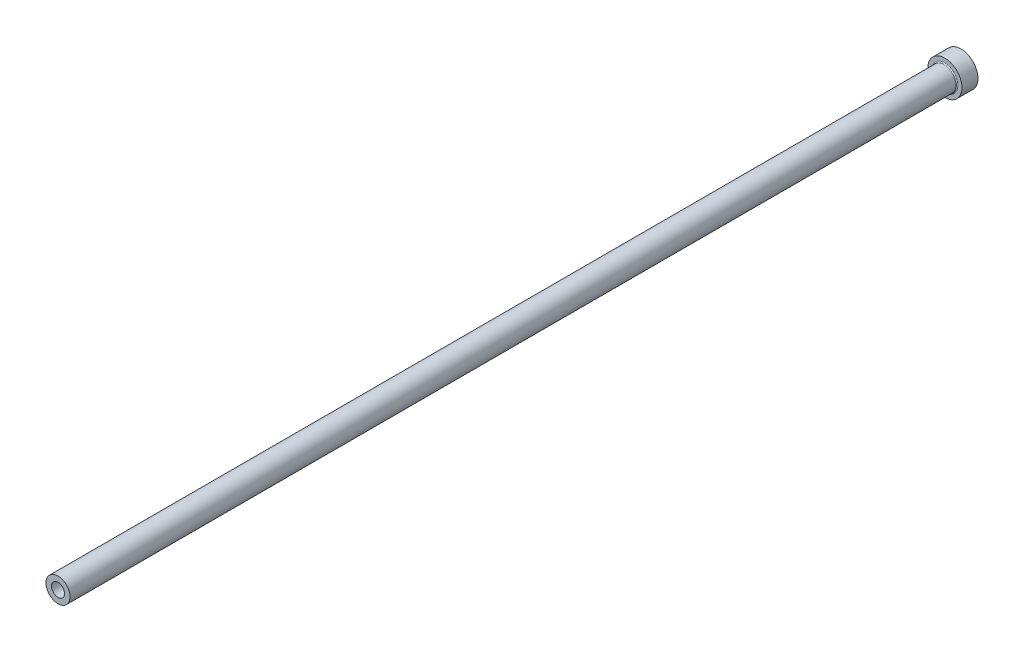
ISO-10303-21;
HEADER;
FILE_DESCRIPTION(('STEP AP214'),'2;1');
FILE_NAME('part.step','',(''),(''),'','','');
FILE_SCHEMA(('AUTOMOTIVE_DESIGN { 1 0 10303 214 1 1 1 1 }'));
ENDSEC;
DATA;
#1=APPLICATION_CONTEXT('core data for automotive mechanical design processes');
#2=APPLICATION_PROTOCOL_DEFINITION('international standard','automotive_design',2000,#1);
#3=PRODUCT_CONTEXT('',#1,'mechanical');
#4=PRODUCT('Part','Part','',(#3));
#5=PRODUCT_RELATED_PRODUCT_CATEGORY('part','',(#4));
#6=PRODUCT_DEFINITION_FORMATION('','',#4);
#7=PRODUCT_DEFINITION_CONTEXT('part definition',#1,'design');
#8=PRODUCT_DEFINITION('design','',#6,#7);
#9=PRODUCT_DEFINITION_SHAPE('','',#8);
#10=(LENGTH_UNIT() NAMED_UNIT(*) SI_UNIT(.MILLI.,.METRE.));
#11=(NAMED_UNIT(*) PLANE_ANGLE_UNIT() SI_UNIT($,.RADIAN.));
#12=(NAMED_UNIT(*) SI_UNIT($,.STERADIAN.) SOLID_ANGLE_UNIT());
#13=UNCERTAINTY_MEASURE_WITH_UNIT(LENGTH_MEASURE(1.E-05),#10,'distance_accuracy_value','');
#14=(GEOMETRIC_REPRESENTATION_CONTEXT(3) GLOBAL_UNCERTAINTY_ASSIGNED_CONTEXT((#13)) GLOBAL_UNIT_ASSIGNED_CONTEXT((#10,
#11,#12)) REPRESENTATION_CONTEXT('',''));
#15=CARTESIAN_POINT('',(0.,0.,0.));
#16=DIRECTION('',(0.,0.,1.));
#17=DIRECTION('',(1.,0.,0.));
#18=AXIS2_PLACEMENT_3D('',#15,#16,#17);
#19=CARTESIAN_POINT('',(0.,0.,450.));
#20=DIRECTION('',(0.,0.,-1.));
#21=DIRECTION('',(-1.,0.,0.));
#22=AXIS2_PLACEMENT_3D('',#19,#20,#21);
#23=PLANE('',#22);
#24=CARTESIAN_POINT('',(0.,0.,450.));
#25=DIRECTION('',(0.,0.,1.));
#26=DIRECTION('',(1.,0.,0.));
#27=AXIS2_PLACEMENT_3D('',#24,#25,#26);
#28=CIRCLE('',#27,3.24999999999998);
#29=CARTESIAN_POINT('',(3.24999999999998,0.,450.));
#30=VERTEX_POINT('',#29);
#31=EDGE_CURVE('E63',#30,#30,#28,.T.);
#32=ORIENTED_EDGE('',*,*,#31,.F.);
#33=EDGE_LOOP('',(#32));
#34=FACE_BOUND('',#33,.T.);
#35=CARTESIAN_POINT('',(0.,0.,450.));
#36=DIRECTION('',(0.,0.,1.));
#37=DIRECTION('',(1.,0.,0.));
#38=AXIS2_PLACEMENT_3D('',#35,#36,#37);
#39=CIRCLE('',#38,5.99999999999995);
#40=CARTESIAN_POINT('',(5.99999999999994,0.,450.));
#41=VERTEX_POINT('',#40);
#42=EDGE_CURVE('E54',#41,#41,#39,.T.);
#43=ORIENTED_EDGE('',*,*,#42,.T.);
#44=EDGE_LOOP('',(#43));
#45=FACE_BOUND('',#44,.T.);
#46=ADVANCED_FACE('F34',(#34,#45),#23,.F.);
#47=CARTESIAN_POINT('',(0.,0.,450.));
#48=DIRECTION('',(0.,0.,1.));
#49=DIRECTION('',(1.,0.,0.));
#50=AXIS2_PLACEMENT_3D('',#47,#48,#49);
#51=CYLINDRICAL_SURFACE('',#50,5.99999999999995);
#52=CARTESIAN_POINT('',(0.,0.,8.50000000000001));
#53=DIRECTION('',(0.,0.,1.));
#54=DIRECTION('',(1.,0.,0.));
#55=AXIS2_PLACEMENT_3D('',#52,#53,#54);
#56=CIRCLE('',#55,5.99999999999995);
#57=CARTESIAN_POINT('',(5.99999999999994,0.,8.50000000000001));
#58=VERTEX_POINT('',#57);
#59=EDGE_CURVE('E49',#58,#58,#56,.T.);
#60=ORIENTED_EDGE('',*,*,#59,.T.);
#61=EDGE_LOOP('',(#60));
#62=FACE_BOUND('',#61,.T.);
#63=ORIENTED_EDGE('',*,*,#42,.F.);
#64=EDGE_LOOP('',(#63));
#65=FACE_BOUND('',#64,.T.);
#66=ADVANCED_FACE('F92',(#62,#65),#51,.T.);
#67=CARTESIAN_POINT('',(0.,0.,8.));
#68=DIRECTION('',(0.,0.,1.));
#69=DIRECTION('',(1.,0.,0.));
#70=AXIS2_PLACEMENT_3D('',#67,#68,#69);
#71=PLANE('',#70);
#72=CARTESIAN_POINT('',(0.,0.,8.));
#73=DIRECTION('',(0.,0.,1.));
#74=DIRECTION('',(1.,0.,0.));
#75=AXIS2_PLACEMENT_3D('',#72,#73,#74);
#76=CIRCLE('',#75,6.49999999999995);
#77=CARTESIAN_POINT('',(6.49999999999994,0.,8.));
#78=VERTEX_POINT('',#77);
#79=EDGE_CURVE('E45',#78,#78,#76,.F.);
#80=ORIENTED_EDGE('',*,*,#79,.T.);
#81=EDGE_LOOP('',(#80));
#82=FACE_BOUND('',#81,.T.);
#83=CARTESIAN_POINT('',(0.,0.,8.00000000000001));
#84=DIRECTION('',(0.,0.,1.));
#85=DIRECTION('',(1.,0.,0.));
#86=AXIS2_PLACEMENT_3D('',#83,#84,#85);
#87=CIRCLE('',#86,8.49999999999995);
#88=CARTESIAN_POINT('',(8.49999999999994,0.,8.00000000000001));
#89=VERTEX_POINT('',#88);
#90=EDGE_CURVE('E57',#89,#89,#87,.T.);
#91=ORIENTED_EDGE('',*,*,#90,.T.);
#92=EDGE_LOOP('',(#91));
#93=FACE_BOUND('',#92,.T.);
#94=ADVANCED_FACE('F98',(#82,#93),#71,.T.);
#95=CARTESIAN_POINT('',(0.,0.,450.));
#96=DIRECTION('',(0.,0.,1.));
#97=DIRECTION('',(1.,0.,0.));
#98=AXIS2_PLACEMENT_3D('',#95,#96,#97);
#99=CYLINDRICAL_SURFACE('',#98,8.49999999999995);
#100=ORIENTED_EDGE('',*,*,#90,.F.);
#101=EDGE_LOOP('',(#100));
#102=FACE_BOUND('',#101,.T.);
#103=CARTESIAN_POINT('',(0.,0.,0.));
#104=DIRECTION('',(0.,0.,1.));
#105=DIRECTION('',(1.,0.,0.));
#106=AXIS2_PLACEMENT_3D('',#103,#104,#105);
#107=CIRCLE('',#106,8.49999999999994);
#108=CARTESIAN_POINT('',(8.49999999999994,0.,0.));
#109=VERTEX_POINT('',#108);
#110=EDGE_CURVE('E60',#109,#109,#107,.T.);
#111=ORIENTED_EDGE('',*,*,#110,.T.);
#112=EDGE_LOOP('',(#111));
#113=FACE_BOUND('',#112,.T.);
#114=ADVANCED_FACE('F89',(#102,#113),#99,.T.);
#115=CARTESIAN_POINT('',(0.,0.,0.));
#116=DIRECTION('',(0.,0.,1.));
#117=DIRECTION('',(1.,0.,0.));
#118=AXIS2_PLACEMENT_3D('',#115,#116,#117);
#119=PLANE('',#118);
#120=CARTESIAN_POINT('',(0.,0.,0.));
#121=DIRECTION('',(0.,0.,1.));
#122=DIRECTION('',(1.,0.,0.));
#123=AXIS2_PLACEMENT_3D('',#120,#121,#122);
#124=CIRCLE('',#123,4.);
#125=CARTESIAN_POINT('',(3.99999999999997,0.,0.));
#126=VERTEX_POINT('',#125);
#127=EDGE_CURVE('E41',#126,#126,#124,.T.);
#128=ORIENTED_EDGE('',*,*,#127,.T.);
#129=EDGE_LOOP('',(#128));
#130=FACE_BOUND('',#129,.T.);
#131=ORIENTED_EDGE('',*,*,#110,.F.);
#132=EDGE_LOOP('',(#131));
#133=FACE_BOUND('',#132,.T.);
#134=ADVANCED_FACE('F83',(#130,#133),#119,.F.);
#135=CARTESIAN_POINT('',(0.,0.,450.));
#136=DIRECTION('',(0.,0.,1.));
#137=DIRECTION('',(1.,0.,0.));
#138=AXIS2_PLACEMENT_3D('',#135,#136,#137);
#139=CYLINDRICAL_SURFACE('',#138,3.25);
#140=ORIENTED_EDGE('',*,*,#31,.T.);
#141=EDGE_LOOP('',(#140));
#142=FACE_BOUND('',#141,.T.);
#143=CARTESIAN_POINT('',(0.,0.,300.));
#144=DIRECTION('',(0.,0.,1.));
#145=DIRECTION('',(1.,0.,0.));
#146=AXIS2_PLACEMENT_3D('',#143,#144,#145);
#147=CIRCLE('',#146,3.25000000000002);
#148=CARTESIAN_POINT('',(3.25,0.,300.));
#149=VERTEX_POINT('',#148);
#150=EDGE_CURVE('E66',#149,#149,#147,.T.);
#151=ORIENTED_EDGE('',*,*,#150,.F.);
#152=EDGE_LOOP('',(#151));
#153=FACE_BOUND('',#152,.T.);
#154=ADVANCED_FACE('F78',(#142,#153),#139,.F.);
#155=CARTESIAN_POINT('',(0.,0.,300.));
#156=DIRECTION('',(0.,0.,-1.));
#157=DIRECTION('',(-1.,0.,0.));
#158=AXIS2_PLACEMENT_3D('',#155,#156,#157);
#159=CONICAL_SURFACE('',#158,3.25000000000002,0.523598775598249);
#160=CARTESIAN_POINT('',(0.,0.,299.566987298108));
#161=DIRECTION('',(0.,0.,1.));
#162=DIRECTION('',(1.,0.,0.));
#163=AXIS2_PLACEMENT_3D('',#160,#161,#162);
#164=CIRCLE('',#163,3.49999999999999);
#165=CARTESIAN_POINT('',(3.49999999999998,0.,299.566987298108));
#166=VERTEX_POINT('',#165);
#167=EDGE_CURVE('E69',#166,#166,#164,.T.);
#168=ORIENTED_EDGE('',*,*,#167,.F.);
#169=EDGE_LOOP('',(#168));
#170=FACE_BOUND('',#169,.T.);
#171=ORIENTED_EDGE('',*,*,#150,.T.);
#172=EDGE_LOOP('',(#171));
#173=FACE_BOUND('',#172,.T.);
#174=ADVANCED_FACE('F75',(#170,#173),#159,.F.);
#175=CARTESIAN_POINT('',(0.,0.,450.));
#176=DIRECTION('',(0.,0.,1.));
#177=DIRECTION('',(1.,0.,0.));
#178=AXIS2_PLACEMENT_3D('',#175,#176,#177);
#179=CYLINDRICAL_SURFACE('',#178,3.49999999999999);
#180=CARTESIAN_POINT('',(0.,0.,0.500000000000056));
#181=DIRECTION('',(0.,0.,1.));
#182=DIRECTION('',(1.,0.,0.));
#183=AXIS2_PLACEMENT_3D('',#180,#181,#182);
#184=CIRCLE('',#183,3.49999999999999);
#185=CARTESIAN_POINT('',(3.49999999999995,0.,0.500000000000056));
#186=VERTEX_POINT('',#185);
#187=EDGE_CURVE('E10',#186,#186,#184,.F.);
#188=ORIENTED_EDGE('',*,*,#187,.T.);
#189=EDGE_LOOP('',(#188));
#190=FACE_BOUND('',#189,.T.);
#191=ORIENTED_EDGE('',*,*,#167,.T.);
#192=EDGE_LOOP('',(#191));
#193=FACE_BOUND('',#192,.T.);
#194=ADVANCED_FACE('F73',(#190,#193),#179,.F.);
#195=CARTESIAN_POINT('',(0.,0.,8.50000000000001));
#196=DIRECTION('',(0.,0.,1.));
#197=DIRECTION('',(1.,0.,0.));
#198=AXIS2_PLACEMENT_3D('',#195,#196,#197);
#199=TOROIDAL_SURFACE('',#198,6.49999999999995,0.5);
#200=ORIENTED_EDGE('',*,*,#79,.F.);
#201=EDGE_LOOP('',(#200));
#202=FACE_BOUND('',#201,.T.);
#203=ORIENTED_EDGE('',*,*,#59,.F.);
#204=EDGE_LOOP('',(#203));
#205=FACE_BOUND('',#204,.T.);
#206=ADVANCED_FACE('F104',(#202,#205),#199,.F.);
#207=CARTESIAN_POINT('',(0.,0.,0.));
#208=DIRECTION('',(0.,0.,-1.));
#209=DIRECTION('',(-1.,0.,0.));
#210=AXIS2_PLACEMENT_3D('',#207,#208,#209);
#211=CONICAL_SURFACE('',#210,4.,0.785398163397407);
#212=ORIENTED_EDGE('',*,*,#187,.F.);
#213=EDGE_LOOP('',(#212));
#214=FACE_BOUND('',#213,.T.);
#215=ORIENTED_EDGE('',*,*,#127,.F.);
#216=EDGE_LOOP('',(#215));
#217=FACE_BOUND('',#216,.T.);
#218=ADVANCED_FACE('F36',(#214,#217),#211,.F.);
#219=CLOSED_SHELL('',(#46,#66,#94,#114,#134,#154,#174,#194,#206,#218));
#220=MANIFOLD_SOLID_BREP('B2',#219);
#221=ADVANCED_BREP_SHAPE_REPRESENTATION('',(#18,#220),#14);
#222=SHAPE_DEFINITION_REPRESENTATION(#9,#221);
ENDSEC;
END-ISO-10303-21;
